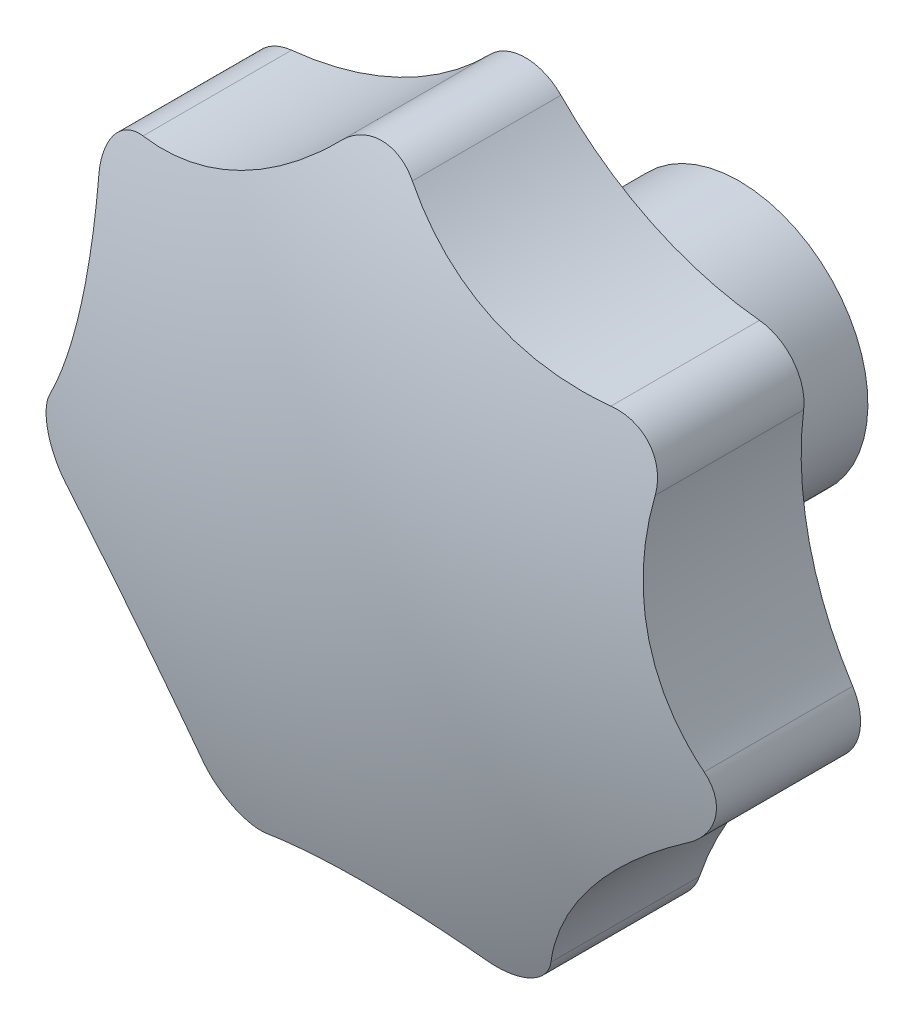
from build123d import *

# Parameters (mm, degrees)
SKETCH1_W          = 11.938
SKETCH1_H          = 3.1877
SKETCH6_W          = 12.573
SKETCH6_H          = 3.8227
CUT_EXTRUDE1_DEPTH = 25.538950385
CIRPATTERN2_COUNT  = 7


with BuildPart() as part:
    # Sketch1 → Revolve1 (revolve)
    with BuildSketch(Plane(origin=(0, 0, 0), x_dir=(0, 0, -1), z_dir=(1, 0, 0)), mode=Mode.PRIVATE) as revolve1_sk:
        with Locations((0, 1.59385)):
            Rectangle(SKETCH1_W, SKETCH1_H)
    revolve(revolve1_sk.sketch.rotate(Axis((0, 0, 8.5598), (0, 0, -1)), 180), axis=Axis((0, 0, 8.5598), (0, 0, -1)))


with BuildPart() as body_2:
    # Sketch6 → Revolve3 (revolve)
    with BuildSketch(Plane(origin=(0, 0, 0), x_dir=(0, 0, -1), z_dir=(1, 0, 0))):
        with Locations((-0.3175, 1.91135)):
            Rectangle(SKETCH6_W, SKETCH6_H)
    revolve(axis=Axis((0, 0, -5.969), (0, 0, 1)))

    # Combine1: cut part
    add(part.part, mode=Mode.SUBTRACT)


with BuildPart() as body_2_2:
    # Sketch4 → Revolve2 (revolve)
    with BuildSketch(Plane(origin=(0, 0, 0), x_dir=(0, 0, -1), z_dir=(1, 0, 0))):
        with BuildLine():
            Line((5.969, 5.969), (5.969, 3.8227))
            Line((5.969, 3.8227), (-6.604, 3.8227))
            Line((-6.604, 3.8227), (-6.604, 0))
            Line((-6.604, 0), (-13.462, 0))
            ThreePointArc((-13.462, 0), (-12.741930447, 8.06506248), (-10.6045, 15.875))
            Line((-10.6045, 15.875), (-3.937, 15.875))
            Line((-3.937, 15.875), (-3.937, 5.969))
            Line((-3.937, 5.969), (5.969, 5.969))
        make_face()
    revolve(axis=Axis((0, 0, -5.969), (0, 0, 1)))

    # Sketch5 → Cut-Extrude1 (cut, through all)
    with BuildSketch(Plane(origin=(0, 0, 3.937), x_dir=(-1, 0, 0), z_dir=(0, 0, -1))):
        with BuildLine():
            Line((-12.411574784, 9.897900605), (-14.757069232, 11.76837001))
            ThreePointArc((-14.757069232, 11.76837001), (-8.365830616, 17.371826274), (0, 18.875))
            Line((0, 18.875), (0, 15.875))
            ThreePointArc((0, 15.875), (-0.890097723, 15.69527046), (-1.640717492, 15.184245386))
            ThreePointArc((-1.640717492, 15.184245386), (-5.854718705, 12.157448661), (-10.848550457, 10.749986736))
            ThreePointArc((-10.848550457, 10.749986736), (-11.716089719, 10.481747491), (-12.411574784, 9.897900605))
        make_face()
    cut_extrude1 = extrude(amount=-CUT_EXTRUDE1_DEPTH, mode=Mode.SUBTRACT)

    # CirPattern2: Cut-Extrude1 ×7 about axis
    cirpattern2_axis = Axis((0, 0, 0), (0, 0, 1))
    for i in range(1, CIRPATTERN2_COUNT):
        add(cut_extrude1.rotate(cirpattern2_axis, i * 360 / CIRPATTERN2_COUNT), mode=Mode.SUBTRACT)


solid = Compound([body_2.part, body_2_2.part])
